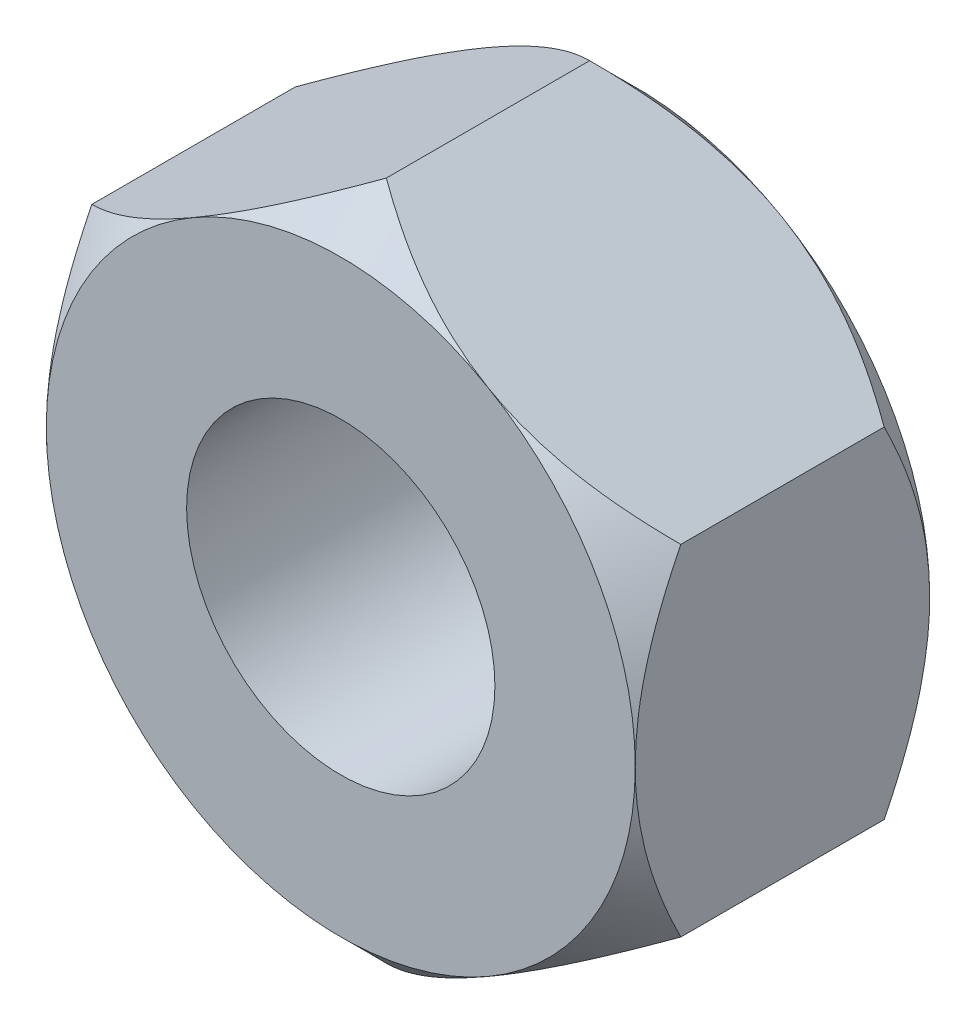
from build123d import *

# Parameters (mm, degrees)
BASE_EXTRUDE_DEPTH = 4
SKETCH4_R          = 4.188
CUT_EXTRUDE1_DEPTH = 15.605934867


with BuildPart() as part:
    # Sketch1 → Base-Extrude (new, symmetric)
    with BuildSketch(Plane.XY):
        Polygon((8, 4.618802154), (8, -4.618802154), (0, -9.237604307), (-8, -4.618802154), (-8, 4.618802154), (0, 9.237604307), align=None)
    extrude(amount=BASE_EXTRUDE_DEPTH, both=True)

    # Sketch3 → Cut-Revolve1 (revolve, cut)
    with BuildSketch(Plane(origin=(0, 0, 0), x_dir=(1, 0, 0), z_dir=(0, 1, 0))):
        Polygon((-13, 4), (-8, 4), (-13, -1), align=None)
    cut_revolve1 = revolve(axis=Axis((0, 0, -4), (0, 0, 1)), mode=Mode.SUBTRACT)

    # Mirror1: Cut-Revolve1 across plane
    add(cut_revolve1.mirror(Plane.XY), mode=Mode.SUBTRACT)

    # Sketch4 → Cut-Extrude1 (cut, through all)
    with BuildSketch(Plane.XY.offset(4)):
        Circle(SKETCH4_R)
    extrude(amount=-CUT_EXTRUDE1_DEPTH, mode=Mode.SUBTRACT)


solid = part.part
